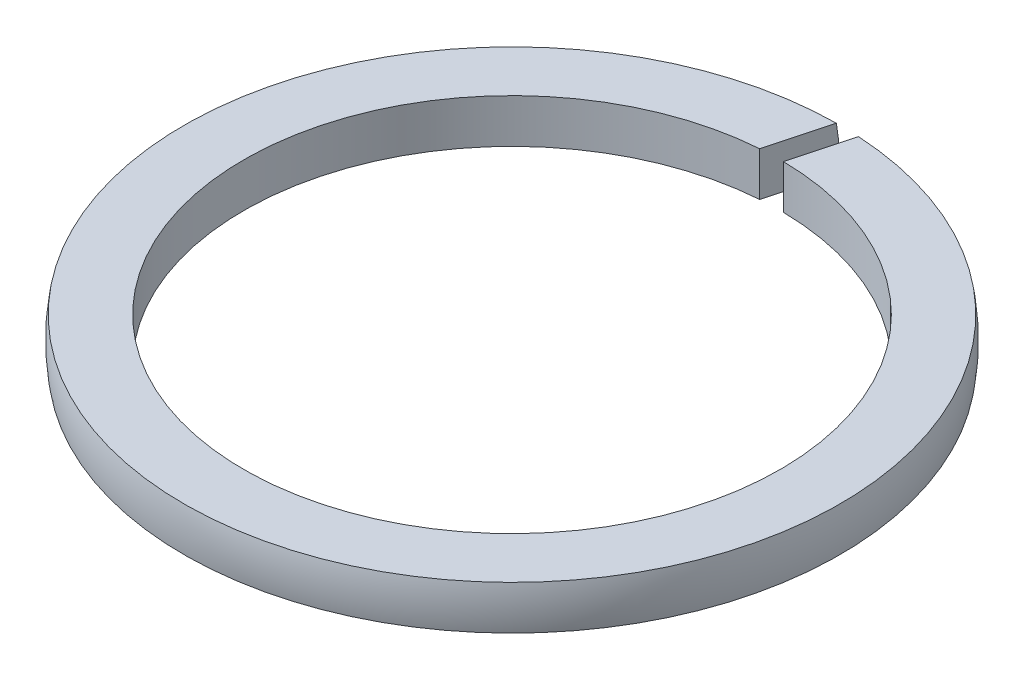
from build123d import *

# Parameters (mm, degrees)
ENL_V_MAT_EXTRU_1_DEPTH      = 11.618380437
ENL_V_MAT_EXTRU_1_DEPTH_BACK = 11.618380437


with BuildPart() as part:
    # Esquisse1 → R_volution1 (revolve)
    with BuildSketch(Plane.XY, mode=Mode.PRIVATE) as r_volution1_sk:
        with BuildLine():
            Line((-6.1, -0.5), (-7.458039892, -0.5))
            ThreePointArc((-7.458039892, -0.5), (-7.5, 0), (-7.458039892, 0.5))
            Line((-7.458039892, 0.5), (-6.1, 0.5))
            Line((-6.1, 0.5), (-6.1, -0.5))
        make_face()
    revolve(r_volution1_sk.sketch.rotate(Axis((0, 0, 0), (0, 1, 0)), 270), axis=Axis((0, 0, 0), (0, 1, 0)))

    # Esquisse2 → Enl_v. mat.-Extru.1 (cut, two sides: drawn at the far end of the back side and taken through both)
    with BuildSketch(Plane(origin=(0, 0, 0), x_dir=(1, 0, 0), z_dir=(0, 1, 0)).offset(-ENL_V_MAT_EXTRU_1_DEPTH_BACK)):
        Polygon((-0.070483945, 7.499668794), (-0.449977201, 6.083380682), (0.072000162, 6.099575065), (0.448460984, 7.50454598), align=None)
    extrude(amount=ENL_V_MAT_EXTRU_1_DEPTH + ENL_V_MAT_EXTRU_1_DEPTH_BACK, mode=Mode.SUBTRACT)


solid = part.part
